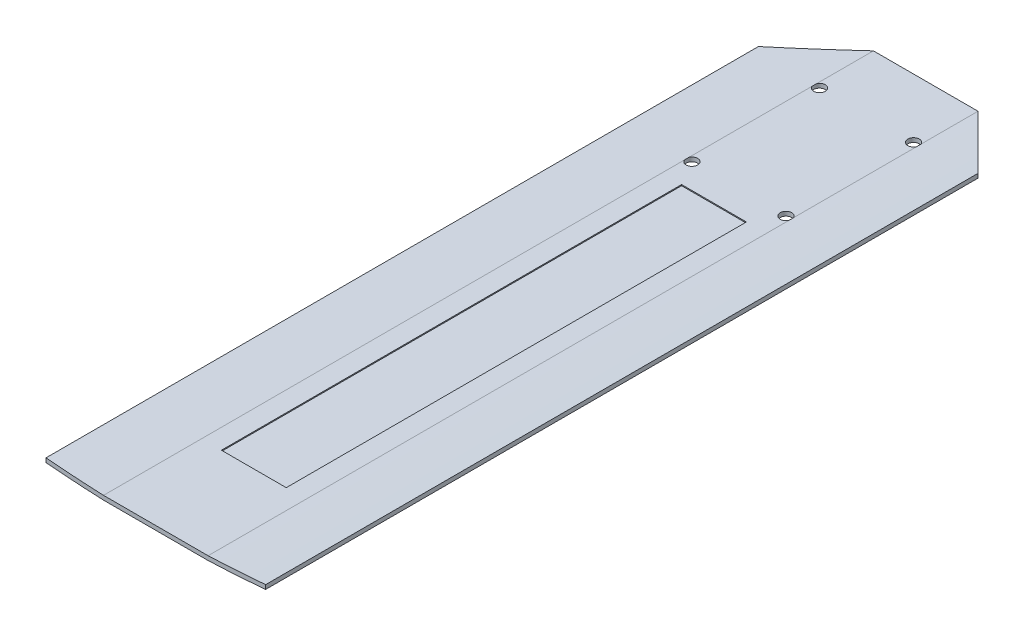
ISO-10303-21;
HEADER;
FILE_DESCRIPTION(('STEP AP214'),'2;1');
FILE_NAME('part.step','',(''),(''),'','','');
FILE_SCHEMA(('AUTOMOTIVE_DESIGN { 1 0 10303 214 1 1 1 1 }'));
ENDSEC;
DATA;
#1=APPLICATION_CONTEXT('core data for automotive mechanical design processes');
#2=APPLICATION_PROTOCOL_DEFINITION('international standard','automotive_design',2000,#1);
#3=PRODUCT_CONTEXT('',#1,'mechanical');
#4=PRODUCT('Part','Part','',(#3));
#5=PRODUCT_RELATED_PRODUCT_CATEGORY('part','',(#4));
#6=PRODUCT_DEFINITION_FORMATION('','',#4);
#7=PRODUCT_DEFINITION_CONTEXT('part definition',#1,'design');
#8=PRODUCT_DEFINITION('design','',#6,#7);
#9=PRODUCT_DEFINITION_SHAPE('','',#8);
#10=(LENGTH_UNIT() NAMED_UNIT(*) SI_UNIT(.MILLI.,.METRE.));
#11=(NAMED_UNIT(*) PLANE_ANGLE_UNIT() SI_UNIT($,.RADIAN.));
#12=(NAMED_UNIT(*) SI_UNIT($,.STERADIAN.) SOLID_ANGLE_UNIT());
#13=UNCERTAINTY_MEASURE_WITH_UNIT(LENGTH_MEASURE(1.E-05),#10,'distance_accuracy_value','');
#14=(GEOMETRIC_REPRESENTATION_CONTEXT(3) GLOBAL_UNCERTAINTY_ASSIGNED_CONTEXT((#13)) GLOBAL_UNIT_ASSIGNED_CONTEXT((#10,
#11,#12)) REPRESENTATION_CONTEXT('',''));
#15=CARTESIAN_POINT('',(0.,0.,0.));
#16=DIRECTION('',(0.,0.,1.));
#17=DIRECTION('',(1.,0.,0.));
#18=AXIS2_PLACEMENT_3D('',#15,#16,#17);
#19=CARTESIAN_POINT('',(-25.,-9.64845629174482,-590.));
#20=DIRECTION('',(0.,-1.,0.));
#21=DIRECTION('',(0.,0.,-1.));
#22=AXIS2_PLACEMENT_3D('',#19,#20,#21);
#23=PLANE('',#22);
#24=CARTESIAN_POINT('',(22.5,-9.64845629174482,-440.471333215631));
#25=DIRECTION('',(0.,-1.,0.));
#26=DIRECTION('',(0.,0.,-1.));
#27=AXIS2_PLACEMENT_3D('',#24,#25,#26);
#28=CIRCLE('',#27,2.75);
#29=CARTESIAN_POINT('',(24.9999999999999,-9.64845629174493,-439.325689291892));
#30=VERTEX_POINT('',#29);
#31=CARTESIAN_POINT('',(25.0000000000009,-9.64845629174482,-441.616977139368));
#32=VERTEX_POINT('',#31);
#33=EDGE_CURVE('E58',#30,#32,#28,.T.);
#34=ORIENTED_EDGE('',*,*,#33,.F.);
#35=DIRECTION('',(0.,0.,1.));
#36=VECTOR('',#35,1.);
#37=CARTESIAN_POINT('',(25.0000000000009,-9.64845629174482,-590.));
#38=LINE('',#37,#36);
#39=CARTESIAN_POINT('',(25.0000000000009,-9.64845629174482,-161.683157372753));
#40=VERTEX_POINT('',#39);
#41=EDGE_CURVE('E357',#30,#40,#38,.T.);
#42=ORIENTED_EDGE('',*,*,#41,.T.);
#43=DIRECTION('',(1.,0.,0.));
#44=VECTOR('',#43,1.);
#45=CARTESIAN_POINT('',(-52.5,-9.64845629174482,-161.683157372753));
#46=LINE('',#45,#44);
#47=CARTESIAN_POINT('',(-25.,-9.64845629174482,-161.683157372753));
#48=VERTEX_POINT('',#47);
#49=EDGE_CURVE('E286',#48,#40,#46,.T.);
#50=ORIENTED_EDGE('',*,*,#49,.F.);
#51=DIRECTION('',(0.,0.,1.));
#52=VECTOR('',#51,1.);
#53=CARTESIAN_POINT('',(-25.,-9.64845629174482,-590.));
#54=LINE('',#53,#52);
#55=CARTESIAN_POINT('',(-25.,-9.64845629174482,-439.325689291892));
#56=VERTEX_POINT('',#55);
#57=EDGE_CURVE('E339',#56,#48,#54,.T.);
#58=ORIENTED_EDGE('',*,*,#57,.F.);
#59=CARTESIAN_POINT('',(-22.5,-9.64845629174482,-440.471333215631));
#60=DIRECTION('',(0.,-1.,0.));
#61=DIRECTION('',(0.,0.,-1.));
#62=AXIS2_PLACEMENT_3D('',#59,#60,#61);
#63=CIRCLE('',#62,2.75);
#64=CARTESIAN_POINT('',(-25.0000000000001,-9.64845629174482,-441.61697713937));
#65=VERTEX_POINT('',#64);
#66=EDGE_CURVE('E283',#65,#56,#63,.T.);
#67=ORIENTED_EDGE('',*,*,#66,.F.);
#68=CARTESIAN_POINT('',(-25.,-9.64845629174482,-500.325689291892));
#69=VERTEX_POINT('',#68);
#70=EDGE_CURVE('E361',#69,#65,#54,.T.);
#71=ORIENTED_EDGE('',*,*,#70,.F.);
#72=CARTESIAN_POINT('',(-22.5,-9.64845629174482,-501.471333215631));
#73=DIRECTION('',(0.,-1.,0.));
#74=DIRECTION('',(0.,0.,-1.));
#75=AXIS2_PLACEMENT_3D('',#72,#73,#74);
#76=CIRCLE('',#75,2.75);
#77=CARTESIAN_POINT('',(-25.0000000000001,-9.64845629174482,-502.61697713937));
#78=VERTEX_POINT('',#77);
#79=EDGE_CURVE('E258',#78,#69,#76,.T.);
#80=ORIENTED_EDGE('',*,*,#79,.F.);
#81=CARTESIAN_POINT('',(-25.,-9.64845629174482,-529.754918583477));
#82=VERTEX_POINT('',#81);
#83=EDGE_CURVE('E358',#82,#78,#54,.T.);
#84=ORIENTED_EDGE('',*,*,#83,.F.);
#85=DIRECTION('',(-1.,0.,0.));
#86=VECTOR('',#85,1.);
#87=CARTESIAN_POINT('',(25.,-9.64845629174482,-529.754918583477));
#88=LINE('',#87,#86);
#89=CARTESIAN_POINT('',(25.,-9.64845629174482,-529.754918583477));
#90=VERTEX_POINT('',#89);
#91=EDGE_CURVE('E289',#90,#82,#88,.T.);
#92=ORIENTED_EDGE('',*,*,#91,.F.);
#93=CARTESIAN_POINT('',(25.0000000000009,-9.64845629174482,-502.616977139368));
#94=VERTEX_POINT('',#93);
#95=EDGE_CURVE('E353',#90,#94,#38,.T.);
#96=ORIENTED_EDGE('',*,*,#95,.T.);
#97=CARTESIAN_POINT('',(22.5,-9.64845629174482,-501.471333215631));
#98=DIRECTION('',(0.,-1.,0.));
#99=DIRECTION('',(0.,0.,-1.));
#100=AXIS2_PLACEMENT_3D('',#97,#98,#99);
#101=CIRCLE('',#100,2.75);
#102=CARTESIAN_POINT('',(24.9999999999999,-9.64845629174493,-500.325689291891));
#103=VERTEX_POINT('',#102);
#104=EDGE_CURVE('E248',#103,#94,#101,.T.);
#105=ORIENTED_EDGE('',*,*,#104,.F.);
#106=EDGE_CURVE('E356',#103,#32,#38,.T.);
#107=ORIENTED_EDGE('',*,*,#106,.T.);
#108=EDGE_LOOP('',(#34,#42,#50,#58,#67,#71,#80,#84,#92,#96,#105,#107));
#109=FACE_BOUND('',#108,.T.);
#110=ADVANCED_FACE('F35',(#109),#23,.T.);
#111=CARTESIAN_POINT('',(0.,589.830484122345,-590.));
#112=DIRECTION('',(0.,0.,1.));
#113=DIRECTION('',(1.,0.,0.));
#114=AXIS2_PLACEMENT_3D('',#111,#112,#113);
#115=CYLINDRICAL_SURFACE('',#114,600.);
#116=CARTESIAN_POINT('',(24.9999999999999,-9.64845629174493,-441.61697713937));
#117=CARTESIAN_POINT('',(25.0321911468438,-9.64711374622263,-441.54674833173));
#118=CARTESIAN_POINT('',(25.0614086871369,-9.64589277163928,-441.475158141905));
#119=CARTESIAN_POINT('',(25.1137213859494,-9.64370357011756,-441.329772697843));
#120=CARTESIAN_POINT('',(25.1368166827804,-9.64273533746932,-441.255977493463));
#121=CARTESIAN_POINT('',(25.1767079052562,-9.64106130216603,-441.10670881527));
#122=CARTESIAN_POINT('',(25.1935048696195,-9.64035545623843,-441.031235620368));
#123=CARTESIAN_POINT('',(25.2206887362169,-9.63921239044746,-440.879164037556));
#124=CARTESIAN_POINT('',(25.2310758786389,-9.63877516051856,-440.802565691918));
#125=CARTESIAN_POINT('',(25.2524981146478,-9.63787335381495,-440.571775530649));
#126=CARTESIAN_POINT('',(25.2537996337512,-9.63781842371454,-440.416567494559));
#127=CARTESIAN_POINT('',(25.2303124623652,-9.6388073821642,-440.108349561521));
#128=CARTESIAN_POINT('',(25.2055563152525,-9.63984990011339,-439.955337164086));
#129=CARTESIAN_POINT('',(25.1476378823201,-9.64228148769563,-439.723170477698));
#130=CARTESIAN_POINT('',(25.1232563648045,-9.64330413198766,-439.641733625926));
#131=CARTESIAN_POINT('',(25.0671081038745,-9.64565456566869,-439.481560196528));
#132=CARTESIAN_POINT('',(25.0353501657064,-9.64698199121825,-439.402820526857));
#133=CARTESIAN_POINT('',(24.9999999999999,-9.64845629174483,-439.325689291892));
#134=B_SPLINE_CURVE_WITH_KNOTS('',3,(#116,#117,#118,#119,#120,#121,#122,#123,#124,#125,#126,
#127,#128,#129,#130,#131,#132,#133),.UNSPECIFIED.,.F.,.F.,(4,2,2,2,2,2,2,2,4),(0.,
0.231725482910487,0.463445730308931,0.695127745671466,0.926801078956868,1.39008308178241,
1.85278717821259,2.10750241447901,2.3619151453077),.UNSPECIFIED.);
#135=EDGE_CURVE('E214',#32,#30,#134,.T.);
#136=ORIENTED_EDGE('',*,*,#135,.F.);
#137=ORIENTED_EDGE('',*,*,#106,.F.);
#138=CARTESIAN_POINT('',(24.9999999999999,-9.64845629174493,-502.61697713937));
#139=CARTESIAN_POINT('',(25.0321911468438,-9.64711374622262,-502.54674833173));
#140=CARTESIAN_POINT('',(25.0614086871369,-9.64589277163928,-502.475158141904));
#141=CARTESIAN_POINT('',(25.1137213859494,-9.64370357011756,-502.329772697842));
#142=CARTESIAN_POINT('',(25.1368166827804,-9.64273533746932,-502.255977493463));
#143=CARTESIAN_POINT('',(25.1767079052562,-9.64106130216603,-502.10670881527));
#144=CARTESIAN_POINT('',(25.1935048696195,-9.64035545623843,-502.031235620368));
#145=CARTESIAN_POINT('',(25.2206887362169,-9.63921239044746,-501.879164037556));
#146=CARTESIAN_POINT('',(25.2310758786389,-9.63877516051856,-501.802565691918));
#147=CARTESIAN_POINT('',(25.2524981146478,-9.63787335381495,-501.571775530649));
#148=CARTESIAN_POINT('',(25.2537996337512,-9.63781842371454,-501.416567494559));
#149=CARTESIAN_POINT('',(25.2303124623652,-9.63880738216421,-501.10834956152));
#150=CARTESIAN_POINT('',(25.2055563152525,-9.63984990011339,-500.955337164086));
#151=CARTESIAN_POINT('',(25.1476378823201,-9.64228148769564,-500.723170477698));
#152=CARTESIAN_POINT('',(25.1232563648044,-9.64330413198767,-500.641733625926));
#153=CARTESIAN_POINT('',(25.0671081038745,-9.6456545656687,-500.481560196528));
#154=CARTESIAN_POINT('',(25.0353501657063,-9.64698199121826,-500.402820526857));
#155=CARTESIAN_POINT('',(24.9999999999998,-9.64845629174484,-500.325689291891));
#156=B_SPLINE_CURVE_WITH_KNOTS('',3,(#138,#139,#140,#141,#142,#143,#144,#145,#146,#147,#148,
#149,#150,#151,#152,#153,#154,#155),.UNSPECIFIED.,.F.,.F.,(4,2,2,2,2,2,2,2,4),(0.,
0.231725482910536,0.463445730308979,0.69512774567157,0.92680107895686,1.39008308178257,
1.85278717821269,2.10750241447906,2.36191514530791),.UNSPECIFIED.);
#157=EDGE_CURVE('E243',#94,#103,#156,.T.);
#158=ORIENTED_EDGE('',*,*,#157,.F.);
#159=ORIENTED_EDGE('',*,*,#95,.F.);
#160=CARTESIAN_POINT('',(0.,589.830484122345,-554.754918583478));
#161=DIRECTION('',(0.707106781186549,0.,-0.707106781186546));
#162=DIRECTION('',(0.707106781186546,0.,0.707106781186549));
#163=AXIS2_PLACEMENT_3D('',#160,#161,#162);
#164=ELLIPSE('',#163,848.528137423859,600.);
#165=CARTESIAN_POINT('',(52.5,-7.8682276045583,-502.254918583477));
#166=VERTEX_POINT('',#165);
#167=EDGE_CURVE('E364',#90,#166,#164,.F.);
#168=ORIENTED_EDGE('',*,*,#167,.T.);
#169=DIRECTION('',(0.,0.,1.));
#170=VECTOR('',#169,1.);
#171=CARTESIAN_POINT('',(52.5,-7.8682276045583,-590.));
#172=LINE('',#171,#170);
#173=CARTESIAN_POINT('',(52.5,-7.8682276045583,-161.683157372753));
#174=VERTEX_POINT('',#173);
#175=EDGE_CURVE('E343',#166,#174,#172,.T.);
#176=ORIENTED_EDGE('',*,*,#175,.T.);
#177=CARTESIAN_POINT('',(0.,589.830484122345,-161.683157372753));
#178=DIRECTION('',(0.,0.,1.));
#179=DIRECTION('',(1.,0.,0.));
#180=AXIS2_PLACEMENT_3D('',#177,#178,#179);
#181=CIRCLE('',#180,600.);
#182=EDGE_CURVE('E296',#174,#40,#181,.F.);
#183=ORIENTED_EDGE('',*,*,#182,.T.);
#184=ORIENTED_EDGE('',*,*,#41,.F.);
#185=EDGE_LOOP('',(#136,#137,#158,#159,#168,#176,#183,#184));
#186=FACE_BOUND('',#185,.T.);
#187=ADVANCED_FACE('F222',(#186),#115,.T.);
#188=CARTESIAN_POINT('',(0.,589.830484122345,-590.));
#189=DIRECTION('',(0.,0.,1.));
#190=DIRECTION('',(1.,0.,0.));
#191=AXIS2_PLACEMENT_3D('',#188,#189,#190);
#192=CYLINDRICAL_SURFACE('',#191,600.);
#193=CARTESIAN_POINT('',(-25.0000000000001,-9.64845629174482,-500.325689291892));
#194=CARTESIAN_POINT('',(-25.032191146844,-9.64711374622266,-500.395918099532));
#195=CARTESIAN_POINT('',(-25.0614086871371,-9.64589277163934,-500.467508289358));
#196=CARTESIAN_POINT('',(-25.1137213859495,-9.64370357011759,-500.612893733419));
#197=CARTESIAN_POINT('',(-25.1368166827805,-9.64273533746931,-500.686688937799));
#198=CARTESIAN_POINT('',(-25.1767079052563,-9.64106130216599,-500.835957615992));
#199=CARTESIAN_POINT('',(-25.1935048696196,-9.64035545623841,-500.911430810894));
#200=CARTESIAN_POINT('',(-25.220688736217,-9.63921239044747,-501.063502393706));
#201=CARTESIAN_POINT('',(-25.231075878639,-9.63877516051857,-501.140100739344));
#202=CARTESIAN_POINT('',(-25.2524981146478,-9.63787335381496,-501.370890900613));
#203=CARTESIAN_POINT('',(-25.2537996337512,-9.63781842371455,-501.526098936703));
#204=CARTESIAN_POINT('',(-25.2303124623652,-9.63880738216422,-501.834316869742));
#205=CARTESIAN_POINT('',(-25.2055563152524,-9.6398499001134,-501.987329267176));
#206=CARTESIAN_POINT('',(-25.14763788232,-9.64228148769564,-502.219495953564));
#207=CARTESIAN_POINT('',(-25.1232563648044,-9.64330413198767,-502.300932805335));
#208=CARTESIAN_POINT('',(-25.0671081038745,-9.6456545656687,-502.461106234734));
#209=CARTESIAN_POINT('',(-25.0353501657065,-9.64698199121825,-502.539845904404));
#210=CARTESIAN_POINT('',(-25.0000000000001,-9.64845629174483,-502.61697713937));
#211=B_SPLINE_CURVE_WITH_KNOTS('',3,(#193,#194,#195,#196,#197,#198,#199,#200,#201,#202,#203,
#204,#205,#206,#207,#208,#209,#210),.UNSPECIFIED.,.F.,.F.,(4,2,2,2,2,2,2,2,4),(0.,
0.231725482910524,0.463445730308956,0.695127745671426,0.926801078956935,1.39008308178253,
1.85278717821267,2.10750241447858,2.36191514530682),.UNSPECIFIED.);
#212=EDGE_CURVE('E253',#69,#78,#211,.T.);
#213=ORIENTED_EDGE('',*,*,#212,.F.);
#214=ORIENTED_EDGE('',*,*,#70,.T.);
#215=CARTESIAN_POINT('',(-25.0000000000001,-9.64845629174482,-439.325689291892));
#216=CARTESIAN_POINT('',(-25.032191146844,-9.64711374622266,-439.395918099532));
#217=CARTESIAN_POINT('',(-25.0614086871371,-9.64589277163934,-439.467508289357));
#218=CARTESIAN_POINT('',(-25.1137213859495,-9.64370357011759,-439.612893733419));
#219=CARTESIAN_POINT('',(-25.1368166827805,-9.6427353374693,-439.686688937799));
#220=CARTESIAN_POINT('',(-25.1767079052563,-9.64106130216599,-439.835957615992));
#221=CARTESIAN_POINT('',(-25.1935048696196,-9.64035545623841,-439.911430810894));
#222=CARTESIAN_POINT('',(-25.220688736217,-9.63921239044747,-440.063502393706));
#223=CARTESIAN_POINT('',(-25.231075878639,-9.63877516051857,-440.140100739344));
#224=CARTESIAN_POINT('',(-25.2524981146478,-9.63787335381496,-440.370890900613));
#225=CARTESIAN_POINT('',(-25.2537996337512,-9.63781842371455,-440.526098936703));
#226=CARTESIAN_POINT('',(-25.2303124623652,-9.63880738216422,-440.834316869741));
#227=CARTESIAN_POINT('',(-25.2055563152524,-9.6398499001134,-440.987329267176));
#228=CARTESIAN_POINT('',(-25.14763788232,-9.64228148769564,-441.219495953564));
#229=CARTESIAN_POINT('',(-25.1232563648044,-9.64330413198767,-441.300932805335));
#230=CARTESIAN_POINT('',(-25.0671081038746,-9.6456545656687,-441.461106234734));
#231=CARTESIAN_POINT('',(-25.0353501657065,-9.64698199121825,-441.539845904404));
#232=CARTESIAN_POINT('',(-25.,-9.64845629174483,-441.61697713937));
#233=B_SPLINE_CURVE_WITH_KNOTS('',3,(#215,#216,#217,#218,#219,#220,#221,#222,#223,#224,#225,
#226,#227,#228,#229,#230,#231,#232),.UNSPECIFIED.,.F.,.F.,(4,2,2,2,2,2,2,2,4),(0.,
0.231725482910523,0.463445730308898,0.695127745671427,0.926801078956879,1.39008308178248,
1.85278717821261,2.10750241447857,2.36191514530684),.UNSPECIFIED.);
#234=EDGE_CURVE('E277',#56,#65,#233,.T.);
#235=ORIENTED_EDGE('',*,*,#234,.F.);
#236=ORIENTED_EDGE('',*,*,#57,.T.);
#237=CARTESIAN_POINT('',(0.,589.830484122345,-161.683157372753));
#238=DIRECTION('',(0.,0.,1.));
#239=DIRECTION('',(1.,0.,0.));
#240=AXIS2_PLACEMENT_3D('',#237,#238,#239);
#241=CIRCLE('',#240,600.);
#242=CARTESIAN_POINT('',(-52.5,-7.86822760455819,-161.683157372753));
#243=VERTEX_POINT('',#242);
#244=EDGE_CURVE('E321',#48,#243,#241,.F.);
#245=ORIENTED_EDGE('',*,*,#244,.T.);
#246=DIRECTION('',(0.,0.,1.));
#247=VECTOR('',#246,1.);
#248=CARTESIAN_POINT('',(-52.5,-7.86822760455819,-590.));
#249=LINE('',#248,#247);
#250=CARTESIAN_POINT('',(-52.5,-7.86822760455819,-502.254918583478));
#251=VERTEX_POINT('',#250);
#252=EDGE_CURVE('E333',#243,#251,#249,.F.);
#253=ORIENTED_EDGE('',*,*,#252,.T.);
#254=CARTESIAN_POINT('',(0.,589.830484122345,-554.754918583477));
#255=DIRECTION('',(-0.707106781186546,0.,-0.707106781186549));
#256=DIRECTION('',(-0.707106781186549,0.,0.707106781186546));
#257=AXIS2_PLACEMENT_3D('',#254,#255,#256);
#258=ELLIPSE('',#257,848.528137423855,600.);
#259=EDGE_CURVE('E336',#251,#82,#258,.F.);
#260=ORIENTED_EDGE('',*,*,#259,.T.);
#261=ORIENTED_EDGE('',*,*,#83,.T.);
#262=EDGE_LOOP('',(#213,#214,#235,#236,#245,#253,#260,#261));
#263=FACE_BOUND('',#262,.T.);
#264=ADVANCED_FACE('F37',(#263),#192,.T.);
#265=CARTESIAN_POINT('',(-25.,-9.64845629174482,-529.754918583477));
#266=DIRECTION('',(-0.707106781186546,0.,-0.707106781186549));
#267=DIRECTION('',(-0.707106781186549,0.,0.707106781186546));
#268=AXIS2_PLACEMENT_3D('',#265,#266,#267);
#269=PLANE('',#268);
#270=DIRECTION('',(0.,1.,0.));
#271=VECTOR('',#270,1.);
#272=CARTESIAN_POINT('',(-52.5,-9.64845629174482,-502.254918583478));
#273=LINE('',#272,#271);
#274=CARTESIAN_POINT('',(-52.5,-5.86822760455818,-502.254918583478));
#275=VERTEX_POINT('',#274);
#276=EDGE_CURVE('E292',#251,#275,#273,.T.);
#277=ORIENTED_EDGE('',*,*,#276,.T.);
#278=CARTESIAN_POINT('',(0.,591.830484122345,-554.754918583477));
#279=DIRECTION('',(-0.707106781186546,0.,-0.707106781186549));
#280=DIRECTION('',(-0.707106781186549,0.,0.707106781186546));
#281=AXIS2_PLACEMENT_3D('',#278,#279,#280);
#282=ELLIPSE('',#281,848.528137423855,600.);
#283=CARTESIAN_POINT('',(-25.,-7.64845629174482,-529.754918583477));
#284=VERTEX_POINT('',#283);
#285=EDGE_CURVE('E44',#284,#275,#282,.T.);
#286=ORIENTED_EDGE('',*,*,#285,.F.);
#287=DIRECTION('',(0.,1.,0.));
#288=VECTOR('',#287,1.);
#289=CARTESIAN_POINT('',(-25.,-9.64845629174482,-529.754918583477));
#290=LINE('',#289,#288);
#291=EDGE_CURVE('E293',#82,#284,#290,.T.);
#292=ORIENTED_EDGE('',*,*,#291,.F.);
#293=ORIENTED_EDGE('',*,*,#259,.F.);
#294=EDGE_LOOP('',(#277,#286,#292,#293));
#295=FACE_BOUND('',#294,.T.);
#296=ADVANCED_FACE('F375',(#295),#269,.T.);
#297=CARTESIAN_POINT('',(25.,-9.64845629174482,-529.754918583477));
#298=DIRECTION('',(0.,0.,-1.));
#299=DIRECTION('',(-1.,0.,0.));
#300=AXIS2_PLACEMENT_3D('',#297,#298,#299);
#301=PLANE('',#300);
#302=DIRECTION('',(0.,1.,0.));
#303=VECTOR('',#302,1.);
#304=CARTESIAN_POINT('',(25.,-9.64845629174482,-529.754918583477));
#305=LINE('',#304,#303);
#306=CARTESIAN_POINT('',(25.,-7.64845629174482,-529.754918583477));
#307=VERTEX_POINT('',#306);
#308=EDGE_CURVE('E297',#90,#307,#305,.T.);
#309=ORIENTED_EDGE('',*,*,#308,.F.);
#310=ORIENTED_EDGE('',*,*,#91,.T.);
#311=ORIENTED_EDGE('',*,*,#291,.T.);
#312=DIRECTION('',(-1.,0.,0.));
#313=VECTOR('',#312,1.);
#314=CARTESIAN_POINT('',(-25.,-7.64845629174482,-529.754918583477));
#315=LINE('',#314,#313);
#316=EDGE_CURVE('E324',#307,#284,#315,.T.);
#317=ORIENTED_EDGE('',*,*,#316,.F.);
#318=EDGE_LOOP('',(#309,#310,#311,#317));
#319=FACE_BOUND('',#318,.T.);
#320=ADVANCED_FACE('F379',(#319),#301,.T.);
#321=CARTESIAN_POINT('',(52.5,-9.64845629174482,-502.254918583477));
#322=DIRECTION('',(0.707106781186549,0.,-0.707106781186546));
#323=DIRECTION('',(-0.707106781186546,0.,-0.707106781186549));
#324=AXIS2_PLACEMENT_3D('',#321,#322,#323);
#325=PLANE('',#324);
#326=DIRECTION('',(0.,1.,0.));
#327=VECTOR('',#326,1.);
#328=CARTESIAN_POINT('',(52.5,-9.64845629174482,-502.254918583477));
#329=LINE('',#328,#327);
#330=CARTESIAN_POINT('',(52.5,-5.8682276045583,-502.254918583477));
#331=VERTEX_POINT('',#330);
#332=EDGE_CURVE('E300',#166,#331,#329,.T.);
#333=ORIENTED_EDGE('',*,*,#332,.F.);
#334=ORIENTED_EDGE('',*,*,#167,.F.);
#335=ORIENTED_EDGE('',*,*,#308,.T.);
#336=CARTESIAN_POINT('',(0.,591.830484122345,-554.754918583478));
#337=DIRECTION('',(0.707106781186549,0.,-0.707106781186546));
#338=DIRECTION('',(0.707106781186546,0.,0.707106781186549));
#339=AXIS2_PLACEMENT_3D('',#336,#337,#338);
#340=ELLIPSE('',#339,848.528137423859,600.);
#341=EDGE_CURVE('E330',#331,#307,#340,.T.);
#342=ORIENTED_EDGE('',*,*,#341,.F.);
#343=EDGE_LOOP('',(#333,#334,#335,#342));
#344=FACE_BOUND('',#343,.T.);
#345=ADVANCED_FACE('F397',(#344),#325,.T.);
#346=CARTESIAN_POINT('',(52.5,-9.64845629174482,-161.683157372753));
#347=DIRECTION('',(1.,0.,0.));
#348=DIRECTION('',(0.,0.,-1.));
#349=AXIS2_PLACEMENT_3D('',#346,#347,#348);
#350=PLANE('',#349);
#351=DIRECTION('',(0.,1.,0.));
#352=VECTOR('',#351,1.);
#353=CARTESIAN_POINT('',(52.5,-9.64845629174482,-161.683157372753));
#354=LINE('',#353,#352);
#355=CARTESIAN_POINT('',(52.5,-5.8682276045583,-161.683157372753));
#356=VERTEX_POINT('',#355);
#357=EDGE_CURVE('E303',#174,#356,#354,.T.);
#358=ORIENTED_EDGE('',*,*,#357,.F.);
#359=ORIENTED_EDGE('',*,*,#175,.F.);
#360=ORIENTED_EDGE('',*,*,#332,.T.);
#361=DIRECTION('',(0.,0.,1.));
#362=VECTOR('',#361,1.);
#363=CARTESIAN_POINT('',(52.5,-5.8682276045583,-590.));
#364=LINE('',#363,#362);
#365=EDGE_CURVE('E327',#356,#331,#364,.F.);
#366=ORIENTED_EDGE('',*,*,#365,.F.);
#367=EDGE_LOOP('',(#358,#359,#360,#366));
#368=FACE_BOUND('',#367,.T.);
#369=ADVANCED_FACE('F400',(#368),#350,.T.);
#370=CARTESIAN_POINT('',(-52.5,-9.64845629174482,-161.683157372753));
#371=DIRECTION('',(0.,0.,1.));
#372=DIRECTION('',(1.,0.,0.));
#373=AXIS2_PLACEMENT_3D('',#370,#371,#372);
#374=PLANE('',#373);
#375=ORIENTED_EDGE('',*,*,#49,.T.);
#376=ORIENTED_EDGE('',*,*,#182,.F.);
#377=ORIENTED_EDGE('',*,*,#357,.T.);
#378=CARTESIAN_POINT('',(0.,591.830484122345,-161.683157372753));
#379=DIRECTION('',(0.,0.,1.));
#380=DIRECTION('',(1.,0.,0.));
#381=AXIS2_PLACEMENT_3D('',#378,#379,#380);
#382=CIRCLE('',#381,600.);
#383=CARTESIAN_POINT('',(25.,-7.64845629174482,-161.683157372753));
#384=VERTEX_POINT('',#383);
#385=EDGE_CURVE('E312',#384,#356,#382,.T.);
#386=ORIENTED_EDGE('',*,*,#385,.F.);
#387=DIRECTION('',(1.,0.,0.));
#388=VECTOR('',#387,1.);
#389=CARTESIAN_POINT('',(-25.,-7.64845629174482,-161.683157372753));
#390=LINE('',#389,#388);
#391=CARTESIAN_POINT('',(-25.0000000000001,-7.64845629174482,-161.683157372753));
#392=VERTEX_POINT('',#391);
#393=EDGE_CURVE('E315',#392,#384,#390,.T.);
#394=ORIENTED_EDGE('',*,*,#393,.F.);
#395=CARTESIAN_POINT('',(0.,591.830484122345,-161.683157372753));
#396=DIRECTION('',(0.,0.,1.));
#397=DIRECTION('',(1.,0.,0.));
#398=AXIS2_PLACEMENT_3D('',#395,#396,#397);
#399=CIRCLE('',#398,600.);
#400=CARTESIAN_POINT('',(-52.5,-5.86822760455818,-161.683157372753));
#401=VERTEX_POINT('',#400);
#402=EDGE_CURVE('E318',#401,#392,#399,.T.);
#403=ORIENTED_EDGE('',*,*,#402,.F.);
#404=DIRECTION('',(0.,1.,0.));
#405=VECTOR('',#404,1.);
#406=CARTESIAN_POINT('',(-52.5,-9.64845629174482,-161.683157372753));
#407=LINE('',#406,#405);
#408=EDGE_CURVE('E305',#243,#401,#407,.T.);
#409=ORIENTED_EDGE('',*,*,#408,.F.);
#410=ORIENTED_EDGE('',*,*,#244,.F.);
#411=EDGE_LOOP('',(#375,#376,#377,#386,#394,#403,#409,#410));
#412=FACE_BOUND('',#411,.T.);
#413=ADVANCED_FACE('F417',(#412),#374,.T.);
#414=CARTESIAN_POINT('',(-52.5,-9.64845629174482,-502.254918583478));
#415=DIRECTION('',(-1.,0.,0.));
#416=DIRECTION('',(0.,0.,1.));
#417=AXIS2_PLACEMENT_3D('',#414,#415,#416);
#418=PLANE('',#417);
#419=ORIENTED_EDGE('',*,*,#408,.T.);
#420=DIRECTION('',(0.,0.,1.));
#421=VECTOR('',#420,1.);
#422=CARTESIAN_POINT('',(-52.5,-5.86822760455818,-590.));
#423=LINE('',#422,#421);
#424=EDGE_CURVE('E367',#275,#401,#423,.T.);
#425=ORIENTED_EDGE('',*,*,#424,.F.);
#426=ORIENTED_EDGE('',*,*,#276,.F.);
#427=ORIENTED_EDGE('',*,*,#252,.F.);
#428=EDGE_LOOP('',(#419,#425,#426,#427));
#429=FACE_BOUND('',#428,.T.);
#430=ADVANCED_FACE('F413',(#429),#418,.T.);
#431=CARTESIAN_POINT('',(0.,591.830484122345,-590.));
#432=DIRECTION('',(0.,0.,1.));
#433=DIRECTION('',(1.,0.,0.));
#434=AXIS2_PLACEMENT_3D('',#431,#432,#433);
#435=CYLINDRICAL_SURFACE('',#434,600.);
#436=DIRECTION('',(0.,0.,1.));
#437=VECTOR('',#436,1.);
#438=CARTESIAN_POINT('',(-25.0000000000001,-7.64845629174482,-590.));
#439=LINE('',#438,#437);
#440=CARTESIAN_POINT('',(-25.0000000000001,-7.64845629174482,-502.61697713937));
#441=VERTEX_POINT('',#440);
#442=EDGE_CURVE('E340',#284,#441,#439,.T.);
#443=ORIENTED_EDGE('',*,*,#442,.F.);
#444=ORIENTED_EDGE('',*,*,#285,.T.);
#445=ORIENTED_EDGE('',*,*,#424,.T.);
#446=ORIENTED_EDGE('',*,*,#402,.T.);
#447=CARTESIAN_POINT('',(-25.0000000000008,-7.64845629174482,-439.325689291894));
#448=VERTEX_POINT('',#447);
#449=EDGE_CURVE('E350',#448,#392,#439,.T.);
#450=ORIENTED_EDGE('',*,*,#449,.F.);
#451=CARTESIAN_POINT('',(-25.0000000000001,-7.64845629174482,-441.616977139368));
#452=VERTEX_POINT('',#451);
#453=EDGE_CURVE('E346',#452,#448,#439,.T.);
#454=ORIENTED_EDGE('',*,*,#453,.F.);
#455=CARTESIAN_POINT('',(-25.0000000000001,-7.64845629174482,-500.325689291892));
#456=VERTEX_POINT('',#455);
#457=EDGE_CURVE('E345',#456,#452,#439,.T.);
#458=ORIENTED_EDGE('',*,*,#457,.F.);
#459=EDGE_CURVE('E344',#441,#456,#439,.T.);
#460=ORIENTED_EDGE('',*,*,#459,.F.);
#461=EDGE_LOOP('',(#443,#444,#445,#446,#450,#454,#458,#460));
#462=FACE_BOUND('',#461,.T.);
#463=ADVANCED_FACE('F372',(#462),#435,.F.);
#464=CARTESIAN_POINT('',(-25.,-7.64845629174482,-590.));
#465=DIRECTION('',(0.,1.,0.));
#466=DIRECTION('',(-1.,0.,0.));
#467=AXIS2_PLACEMENT_3D('',#464,#465,#466);
#468=PLANE('',#467);
#469=DIRECTION('',(0.,0.,1.));
#470=VECTOR('',#469,1.);
#471=CARTESIAN_POINT('',(-15.5000000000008,-7.64845629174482,-428.543599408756));
#472=LINE('',#471,#470);
#473=CARTESIAN_POINT('',(-15.5000000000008,-7.64845629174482,-428.543599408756));
#474=VERTEX_POINT('',#473);
#475=CARTESIAN_POINT('',(-15.5000000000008,-7.64845629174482,-208.543599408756));
#476=VERTEX_POINT('',#475);
#477=EDGE_CURVE('E51',#474,#476,#472,.T.);
#478=ORIENTED_EDGE('',*,*,#477,.F.);
#479=DIRECTION('',(-1.,0.,0.));
#480=VECTOR('',#479,1.);
#481=CARTESIAN_POINT('',(-15.5000000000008,-7.64845629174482,-428.543599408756));
#482=LINE('',#481,#480);
#483=CARTESIAN_POINT('',(15.4999999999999,-7.64845629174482,-428.543599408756));
#484=VERTEX_POINT('',#483);
#485=EDGE_CURVE('E192',#484,#474,#482,.T.);
#486=ORIENTED_EDGE('',*,*,#485,.F.);
#487=DIRECTION('',(0.,0.,-1.));
#488=VECTOR('',#487,1.);
#489=CARTESIAN_POINT('',(15.4999999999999,-7.64845629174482,-428.543599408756));
#490=LINE('',#489,#488);
#491=CARTESIAN_POINT('',(15.4999999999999,-7.64845629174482,-208.543599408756));
#492=VERTEX_POINT('',#491);
#493=EDGE_CURVE('E195',#492,#484,#490,.T.);
#494=ORIENTED_EDGE('',*,*,#493,.F.);
#495=DIRECTION('',(1.,0.,0.));
#496=VECTOR('',#495,1.);
#497=CARTESIAN_POINT('',(-15.5000000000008,-7.64845629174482,-208.543599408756));
#498=LINE('',#497,#496);
#499=EDGE_CURVE('E201',#476,#492,#498,.T.);
#500=ORIENTED_EDGE('',*,*,#499,.F.);
#501=EDGE_LOOP('',(#478,#486,#494,#500));
#502=FACE_BOUND('',#501,.T.);
#503=CARTESIAN_POINT('',(22.5,-7.64845629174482,-440.471333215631));
#504=DIRECTION('',(0.,1.,0.));
#505=DIRECTION('',(0.,0.,1.));
#506=AXIS2_PLACEMENT_3D('',#503,#504,#505);
#507=CIRCLE('',#506,2.75);
#508=CARTESIAN_POINT('',(24.9999999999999,-7.64845629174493,-441.61697713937));
#509=VERTEX_POINT('',#508);
#510=CARTESIAN_POINT('',(24.9999999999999,-7.64845629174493,-439.325689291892));
#511=VERTEX_POINT('',#510);
#512=EDGE_CURVE('E207',#509,#511,#507,.T.);
#513=ORIENTED_EDGE('',*,*,#512,.F.);
#514=DIRECTION('',(0.,0.,1.));
#515=VECTOR('',#514,1.);
#516=CARTESIAN_POINT('',(25.,-7.64845629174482,-590.));
#517=LINE('',#516,#515);
#518=CARTESIAN_POINT('',(24.9999999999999,-7.64845629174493,-500.325689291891));
#519=VERTEX_POINT('',#518);
#520=EDGE_CURVE('E642',#519,#509,#517,.T.);
#521=ORIENTED_EDGE('',*,*,#520,.F.);
#522=CARTESIAN_POINT('',(22.5,-7.64845629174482,-501.471333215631));
#523=DIRECTION('',(0.,1.,0.));
#524=DIRECTION('',(0.,0.,1.));
#525=AXIS2_PLACEMENT_3D('',#522,#523,#524);
#526=CIRCLE('',#525,2.75);
#527=CARTESIAN_POINT('',(24.9999999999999,-7.64845629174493,-502.61697713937));
#528=VERTEX_POINT('',#527);
#529=EDGE_CURVE('E389',#528,#519,#526,.T.);
#530=ORIENTED_EDGE('',*,*,#529,.F.);
#531=EDGE_CURVE('E347',#307,#528,#517,.T.);
#532=ORIENTED_EDGE('',*,*,#531,.F.);
#533=ORIENTED_EDGE('',*,*,#316,.T.);
#534=ORIENTED_EDGE('',*,*,#442,.T.);
#535=CARTESIAN_POINT('',(-22.5,-7.64845629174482,-501.471333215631));
#536=DIRECTION('',(0.,1.,0.));
#537=DIRECTION('',(-1.,0.,0.));
#538=AXIS2_PLACEMENT_3D('',#535,#536,#537);
#539=CIRCLE('',#538,2.75);
#540=EDGE_CURVE('E13',#456,#441,#539,.T.);
#541=ORIENTED_EDGE('',*,*,#540,.F.);
#542=ORIENTED_EDGE('',*,*,#457,.T.);
#543=CARTESIAN_POINT('',(-22.5,-7.64845629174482,-440.471333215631));
#544=DIRECTION('',(0.,1.,0.));
#545=DIRECTION('',(0.,0.,1.));
#546=AXIS2_PLACEMENT_3D('',#543,#544,#545);
#547=CIRCLE('',#546,2.75);
#548=EDGE_CURVE('E428',#448,#452,#547,.T.);
#549=ORIENTED_EDGE('',*,*,#548,.F.);
#550=ORIENTED_EDGE('',*,*,#449,.T.);
#551=ORIENTED_EDGE('',*,*,#393,.T.);
#552=EDGE_CURVE('E352',#511,#384,#517,.T.);
#553=ORIENTED_EDGE('',*,*,#552,.F.);
#554=EDGE_LOOP('',(#513,#521,#530,#532,#533,#534,#541,#542,#549,#550,#551,#553));
#555=FACE_BOUND('',#554,.T.);
#556=ADVANCED_FACE('F384',(#502,#555),#468,.T.);
#557=CARTESIAN_POINT('',(0.,591.830484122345,-590.));
#558=DIRECTION('',(0.,0.,1.));
#559=DIRECTION('',(1.,0.,0.));
#560=AXIS2_PLACEMENT_3D('',#557,#558,#559);
#561=CYLINDRICAL_SURFACE('',#560,600.);
#562=ORIENTED_EDGE('',*,*,#365,.T.);
#563=ORIENTED_EDGE('',*,*,#341,.T.);
#564=ORIENTED_EDGE('',*,*,#531,.T.);
#565=EDGE_CURVE('E351',#528,#519,#517,.T.);
#566=ORIENTED_EDGE('',*,*,#565,.T.);
#567=ORIENTED_EDGE('',*,*,#520,.T.);
#568=EDGE_CURVE('E647',#509,#511,#517,.T.);
#569=ORIENTED_EDGE('',*,*,#568,.T.);
#570=ORIENTED_EDGE('',*,*,#552,.T.);
#571=ORIENTED_EDGE('',*,*,#385,.T.);
#572=EDGE_LOOP('',(#562,#563,#564,#566,#567,#569,#570,#571));
#573=FACE_BOUND('',#572,.T.);
#574=ADVANCED_FACE('F392',(#573),#561,.F.);
#575=CARTESIAN_POINT('',(-19.75,-7.64845629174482,-440.471333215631));
#576=DIRECTION('',(0.,1.,0.));
#577=DIRECTION('',(0.,0.,1.));
#578=AXIS2_PLACEMENT_3D('',#575,#576,#577);
#579=PLANE('',#578);
#580=ORIENTED_EDGE('',*,*,#453,.T.);
#581=EDGE_CURVE('E284',#452,#448,#547,.T.);
#582=ORIENTED_EDGE('',*,*,#581,.F.);
#583=EDGE_LOOP('',(#580,#582));
#584=FACE_BOUND('',#583,.T.);
#585=ADVANCED_FACE('F273',(#584),#579,.F.);
#586=CARTESIAN_POINT('',(-22.5,-7.64845629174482,-440.471333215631));
#587=DIRECTION('',(0.,1.,0.));
#588=DIRECTION('',(0.,0.,1.));
#589=AXIS2_PLACEMENT_3D('',#586,#587,#588);
#590=CYLINDRICAL_SURFACE('',#589,2.75);
#591=ORIENTED_EDGE('',*,*,#66,.T.);
#592=ORIENTED_EDGE('',*,*,#234,.T.);
#593=EDGE_LOOP('',(#591,#592));
#594=FACE_BOUND('',#593,.T.);
#595=ORIENTED_EDGE('',*,*,#581,.T.);
#596=ORIENTED_EDGE('',*,*,#548,.T.);
#597=EDGE_LOOP('',(#595,#596));
#598=FACE_BOUND('',#597,.T.);
#599=ADVANCED_FACE('F268',(#594,#598),#590,.F.);
#600=CARTESIAN_POINT('',(-19.75,-7.64845629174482,-501.471333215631));
#601=DIRECTION('',(0.,1.,0.));
#602=DIRECTION('',(0.,0.,1.));
#603=AXIS2_PLACEMENT_3D('',#600,#601,#602);
#604=PLANE('',#603);
#605=ORIENTED_EDGE('',*,*,#459,.T.);
#606=CARTESIAN_POINT('',(-22.5,-7.64845629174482,-501.471333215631));
#607=DIRECTION('',(0.,1.,0.));
#608=DIRECTION('',(0.,0.,1.));
#609=AXIS2_PLACEMENT_3D('',#606,#607,#608);
#610=CIRCLE('',#609,2.75);
#611=EDGE_CURVE('E251',#441,#456,#610,.T.);
#612=ORIENTED_EDGE('',*,*,#611,.F.);
#613=EDGE_LOOP('',(#605,#612));
#614=FACE_BOUND('',#613,.T.);
#615=ADVANCED_FACE('F264',(#614),#604,.F.);
#616=CARTESIAN_POINT('',(-22.5,-7.64845629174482,-501.471333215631));
#617=DIRECTION('',(0.,1.,0.));
#618=DIRECTION('',(0.,0.,1.));
#619=AXIS2_PLACEMENT_3D('',#616,#617,#618);
#620=CYLINDRICAL_SURFACE('',#619,2.75);
#621=ORIENTED_EDGE('',*,*,#79,.T.);
#622=ORIENTED_EDGE('',*,*,#212,.T.);
#623=EDGE_LOOP('',(#621,#622));
#624=FACE_BOUND('',#623,.T.);
#625=ORIENTED_EDGE('',*,*,#611,.T.);
#626=ORIENTED_EDGE('',*,*,#540,.T.);
#627=EDGE_LOOP('',(#625,#626));
#628=FACE_BOUND('',#627,.T.);
#629=ADVANCED_FACE('F260',(#624,#628),#620,.F.);
#630=CARTESIAN_POINT('',(25.25,-7.64845629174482,-501.471333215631));
#631=DIRECTION('',(0.,1.,0.));
#632=DIRECTION('',(0.,0.,1.));
#633=AXIS2_PLACEMENT_3D('',#630,#631,#632);
#634=PLANE('',#633);
#635=ORIENTED_EDGE('',*,*,#565,.F.);
#636=EDGE_CURVE('E249',#519,#528,#526,.T.);
#637=ORIENTED_EDGE('',*,*,#636,.F.);
#638=EDGE_LOOP('',(#635,#637));
#639=FACE_BOUND('',#638,.T.);
#640=ADVANCED_FACE('F239',(#639),#634,.F.);
#641=CARTESIAN_POINT('',(22.5,-7.64845629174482,-501.471333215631));
#642=DIRECTION('',(0.,1.,0.));
#643=DIRECTION('',(0.,0.,1.));
#644=AXIS2_PLACEMENT_3D('',#641,#642,#643);
#645=CYLINDRICAL_SURFACE('',#644,2.75);
#646=ORIENTED_EDGE('',*,*,#104,.T.);
#647=ORIENTED_EDGE('',*,*,#157,.T.);
#648=EDGE_LOOP('',(#646,#647));
#649=FACE_BOUND('',#648,.T.);
#650=ORIENTED_EDGE('',*,*,#636,.T.);
#651=ORIENTED_EDGE('',*,*,#529,.T.);
#652=EDGE_LOOP('',(#650,#651));
#653=FACE_BOUND('',#652,.T.);
#654=ADVANCED_FACE('F234',(#649,#653),#645,.F.);
#655=CARTESIAN_POINT('',(25.25,-7.64845629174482,-440.471333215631));
#656=DIRECTION('',(0.,1.,0.));
#657=DIRECTION('',(0.,0.,1.));
#658=AXIS2_PLACEMENT_3D('',#655,#656,#657);
#659=PLANE('',#658);
#660=ORIENTED_EDGE('',*,*,#568,.F.);
#661=EDGE_CURVE('E211',#511,#509,#507,.T.);
#662=ORIENTED_EDGE('',*,*,#661,.F.);
#663=EDGE_LOOP('',(#660,#662));
#664=FACE_BOUND('',#663,.T.);
#665=ADVANCED_FACE('F230',(#664),#659,.F.);
#666=CARTESIAN_POINT('',(22.5,-7.64845629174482,-440.471333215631));
#667=DIRECTION('',(0.,1.,0.));
#668=DIRECTION('',(0.,0.,1.));
#669=AXIS2_PLACEMENT_3D('',#666,#667,#668);
#670=CYLINDRICAL_SURFACE('',#669,2.75);
#671=ORIENTED_EDGE('',*,*,#33,.T.);
#672=ORIENTED_EDGE('',*,*,#135,.T.);
#673=EDGE_LOOP('',(#671,#672));
#674=FACE_BOUND('',#673,.T.);
#675=ORIENTED_EDGE('',*,*,#661,.T.);
#676=ORIENTED_EDGE('',*,*,#512,.T.);
#677=EDGE_LOOP('',(#675,#676));
#678=FACE_BOUND('',#677,.T.);
#679=ADVANCED_FACE('F225',(#674,#678),#670,.F.);
#680=CARTESIAN_POINT('',(-15.5000000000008,-8.14845629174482,-428.543599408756));
#681=DIRECTION('',(-1.,0.,0.));
#682=DIRECTION('',(0.,-1.,0.));
#683=AXIS2_PLACEMENT_3D('',#680,#681,#682);
#684=PLANE('',#683);
#685=ORIENTED_EDGE('',*,*,#477,.T.);
#686=DIRECTION('',(0.,1.,0.));
#687=VECTOR('',#686,1.);
#688=CARTESIAN_POINT('',(-15.5000000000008,-8.14845629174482,-208.543599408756));
#689=LINE('',#688,#687);
#690=CARTESIAN_POINT('',(-15.5000000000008,-8.14845629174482,-208.543599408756));
#691=VERTEX_POINT('',#690);
#692=EDGE_CURVE('E170',#691,#476,#689,.T.);
#693=ORIENTED_EDGE('',*,*,#692,.F.);
#694=DIRECTION('',(0.,0.,1.));
#695=VECTOR('',#694,1.);
#696=CARTESIAN_POINT('',(-15.5000000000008,-8.14845629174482,-428.543599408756));
#697=LINE('',#696,#695);
#698=CARTESIAN_POINT('',(-15.5000000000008,-8.14845629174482,-428.543599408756));
#699=VERTEX_POINT('',#698);
#700=EDGE_CURVE('E174',#699,#691,#697,.T.);
#701=ORIENTED_EDGE('',*,*,#700,.F.);
#702=DIRECTION('',(0.,1.,0.));
#703=VECTOR('',#702,1.);
#704=CARTESIAN_POINT('',(-15.5000000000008,-8.14845629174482,-428.543599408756));
#705=LINE('',#704,#703);
#706=EDGE_CURVE('E205',#699,#474,#705,.T.);
#707=ORIENTED_EDGE('',*,*,#706,.T.);
#708=EDGE_LOOP('',(#685,#693,#701,#707));
#709=FACE_BOUND('',#708,.T.);
#710=ADVANCED_FACE('F172',(#709),#684,.F.);
#711=CARTESIAN_POINT('',(-15.5000000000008,-8.14845629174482,-428.543599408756));
#712=DIRECTION('',(0.,0.,-1.));
#713=DIRECTION('',(-1.,0.,0.));
#714=AXIS2_PLACEMENT_3D('',#711,#712,#713);
#715=PLANE('',#714);
#716=ORIENTED_EDGE('',*,*,#485,.T.);
#717=ORIENTED_EDGE('',*,*,#706,.F.);
#718=DIRECTION('',(-1.,0.,0.));
#719=VECTOR('',#718,1.);
#720=CARTESIAN_POINT('',(-15.5000000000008,-8.14845629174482,-428.543599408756));
#721=LINE('',#720,#719);
#722=CARTESIAN_POINT('',(15.4999999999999,-8.14845629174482,-428.543599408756));
#723=VERTEX_POINT('',#722);
#724=EDGE_CURVE('E180',#723,#699,#721,.T.);
#725=ORIENTED_EDGE('',*,*,#724,.F.);
#726=DIRECTION('',(0.,1.,0.));
#727=VECTOR('',#726,1.);
#728=CARTESIAN_POINT('',(15.4999999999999,-8.14845629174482,-428.543599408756));
#729=LINE('',#728,#727);
#730=EDGE_CURVE('E208',#723,#484,#729,.T.);
#731=ORIENTED_EDGE('',*,*,#730,.T.);
#732=EDGE_LOOP('',(#716,#717,#725,#731));
#733=FACE_BOUND('',#732,.T.);
#734=ADVANCED_FACE('F468',(#733),#715,.F.);
#735=CARTESIAN_POINT('',(15.4999999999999,-8.14845629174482,-428.543599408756));
#736=DIRECTION('',(1.,0.,0.));
#737=DIRECTION('',(0.,1.,0.));
#738=AXIS2_PLACEMENT_3D('',#735,#736,#737);
#739=PLANE('',#738);
#740=ORIENTED_EDGE('',*,*,#493,.T.);
#741=ORIENTED_EDGE('',*,*,#730,.F.);
#742=DIRECTION('',(0.,0.,-1.));
#743=VECTOR('',#742,1.);
#744=CARTESIAN_POINT('',(15.4999999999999,-8.14845629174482,-428.543599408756));
#745=LINE('',#744,#743);
#746=CARTESIAN_POINT('',(15.4999999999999,-8.14845629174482,-208.543599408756));
#747=VERTEX_POINT('',#746);
#748=EDGE_CURVE('E188',#747,#723,#745,.T.);
#749=ORIENTED_EDGE('',*,*,#748,.F.);
#750=DIRECTION('',(0.,1.,0.));
#751=VECTOR('',#750,1.);
#752=CARTESIAN_POINT('',(15.4999999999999,-8.14845629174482,-208.543599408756));
#753=LINE('',#752,#751);
#754=EDGE_CURVE('E179',#747,#492,#753,.T.);
#755=ORIENTED_EDGE('',*,*,#754,.T.);
#756=EDGE_LOOP('',(#740,#741,#749,#755));
#757=FACE_BOUND('',#756,.T.);
#758=ADVANCED_FACE('F466',(#757),#739,.F.);
#759=CARTESIAN_POINT('',(-15.5000000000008,-8.14845629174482,-208.543599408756));
#760=DIRECTION('',(0.,0.,1.));
#761=DIRECTION('',(1.,0.,0.));
#762=AXIS2_PLACEMENT_3D('',#759,#760,#761);
#763=PLANE('',#762);
#764=ORIENTED_EDGE('',*,*,#499,.T.);
#765=ORIENTED_EDGE('',*,*,#754,.F.);
#766=DIRECTION('',(1.,0.,0.));
#767=VECTOR('',#766,1.);
#768=CARTESIAN_POINT('',(-15.5000000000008,-8.14845629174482,-208.543599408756));
#769=LINE('',#768,#767);
#770=EDGE_CURVE('E183',#691,#747,#769,.T.);
#771=ORIENTED_EDGE('',*,*,#770,.F.);
#772=ORIENTED_EDGE('',*,*,#692,.T.);
#773=EDGE_LOOP('',(#764,#765,#771,#772));
#774=FACE_BOUND('',#773,.T.);
#775=ADVANCED_FACE('F184',(#774),#763,.F.);
#776=CARTESIAN_POINT('',(-15.5000000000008,-8.14845629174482,-208.543599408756));
#777=DIRECTION('',(0.,1.,0.));
#778=DIRECTION('',(-1.,0.,0.));
#779=AXIS2_PLACEMENT_3D('',#776,#777,#778);
#780=PLANE('',#779);
#781=ORIENTED_EDGE('',*,*,#700,.T.);
#782=ORIENTED_EDGE('',*,*,#770,.T.);
#783=ORIENTED_EDGE('',*,*,#748,.T.);
#784=ORIENTED_EDGE('',*,*,#724,.T.);
#785=EDGE_LOOP('',(#781,#782,#783,#784));
#786=FACE_BOUND('',#785,.T.);
#787=ADVANCED_FACE('F190',(#786),#780,.T.);
#788=CLOSED_SHELL('',(#110,#187,#264,#296,#320,#345,#369,#413,#430,#463,#556,#574,#585,#599,
#615,#629,#640,#654,#665,#679,#710,#734,#758,#775,#787));
#789=MANIFOLD_SOLID_BREP('B2',#788);
#790=ADVANCED_BREP_SHAPE_REPRESENTATION('',(#18,#789),#14);
#791=SHAPE_DEFINITION_REPRESENTATION(#9,#790);
ENDSEC;
END-ISO-10303-21;
